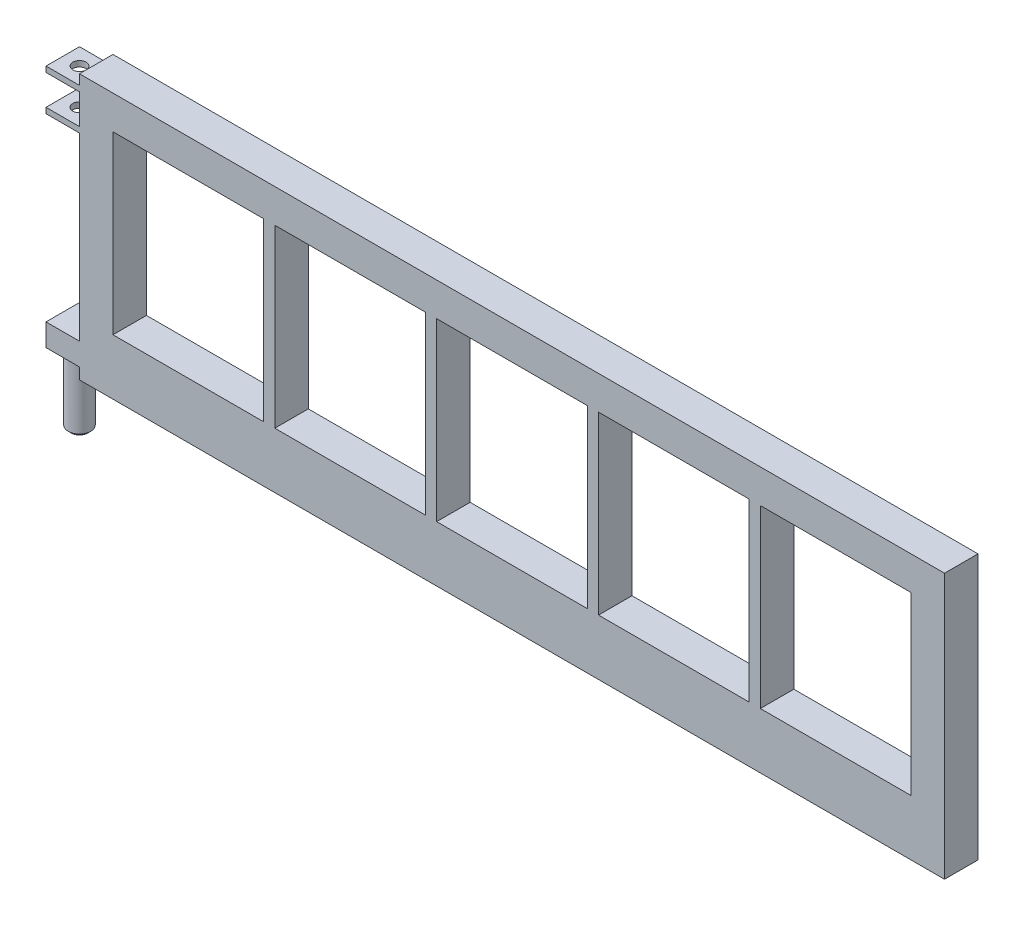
ISO-10303-21;
HEADER;
FILE_DESCRIPTION(('STEP AP214'),'2;1');
FILE_NAME('part.step','',(''),(''),'','','');
FILE_SCHEMA(('AUTOMOTIVE_DESIGN { 1 0 10303 214 1 1 1 1 }'));
ENDSEC;
DATA;
#1=APPLICATION_CONTEXT('core data for automotive mechanical design processes');
#2=APPLICATION_PROTOCOL_DEFINITION('international standard','automotive_design',2000,#1);
#3=PRODUCT_CONTEXT('',#1,'mechanical');
#4=PRODUCT('Part','Part','',(#3));
#5=PRODUCT_RELATED_PRODUCT_CATEGORY('part','',(#4));
#6=PRODUCT_DEFINITION_FORMATION('','',#4);
#7=PRODUCT_DEFINITION_CONTEXT('part definition',#1,'design');
#8=PRODUCT_DEFINITION('design','',#6,#7);
#9=PRODUCT_DEFINITION_SHAPE('','',#8);
#10=(LENGTH_UNIT() NAMED_UNIT(*) SI_UNIT(.MILLI.,.METRE.));
#11=(NAMED_UNIT(*) PLANE_ANGLE_UNIT() SI_UNIT($,.RADIAN.));
#12=(NAMED_UNIT(*) SI_UNIT($,.STERADIAN.) SOLID_ANGLE_UNIT());
#13=UNCERTAINTY_MEASURE_WITH_UNIT(LENGTH_MEASURE(1.E-05),#10,'distance_accuracy_value','');
#14=(GEOMETRIC_REPRESENTATION_CONTEXT(3) GLOBAL_UNCERTAINTY_ASSIGNED_CONTEXT((#13)) GLOBAL_UNIT_ASSIGNED_CONTEXT((#10,
#11,#12)) REPRESENTATION_CONTEXT('',''));
#15=CARTESIAN_POINT('',(0.,0.,0.));
#16=DIRECTION('',(0.,0.,1.));
#17=DIRECTION('',(1.,0.,0.));
#18=AXIS2_PLACEMENT_3D('',#15,#16,#17);
#19=CARTESIAN_POINT('',(-100.,-70.,0.));
#20=DIRECTION('',(0.,0.,1.));
#21=DIRECTION('',(1.,0.,0.));
#22=AXIS2_PLACEMENT_3D('',#19,#20,#21);
#23=PLANE('',#22);
#24=DIRECTION('',(0.,-1.,0.));
#25=VECTOR('',#24,1.);
#26=CARTESIAN_POINT('',(510.,167.501025,0.));
#27=LINE('',#26,#25);
#28=CARTESIAN_POINT('',(510.,137.5,0.));
#29=VERTEX_POINT('',#28);
#30=CARTESIAN_POINT('',(510.,-20.,0.));
#31=VERTEX_POINT('',#30);
#32=EDGE_CURVE('E583',#29,#31,#27,.T.);
#33=ORIENTED_EDGE('',*,*,#32,.T.);
#34=DIRECTION('',(1.,0.,0.));
#35=VECTOR('',#34,1.);
#36=CARTESIAN_POINT('',(-70.,-20.,0.));
#37=LINE('',#36,#35);
#38=CARTESIAN_POINT('',(645.,-20.,0.));
#39=VERTEX_POINT('',#38);
#40=EDGE_CURVE('E652',#31,#39,#37,.T.);
#41=ORIENTED_EDGE('',*,*,#40,.T.);
#42=DIRECTION('',(0.,1.,0.));
#43=VECTOR('',#42,1.);
#44=CARTESIAN_POINT('',(645.,137.5,0.));
#45=LINE('',#44,#43);
#46=CARTESIAN_POINT('',(645.,137.5,0.));
#47=VERTEX_POINT('',#46);
#48=EDGE_CURVE('E656',#39,#47,#45,.T.);
#49=ORIENTED_EDGE('',*,*,#48,.T.);
#50=DIRECTION('',(-1.,0.,0.));
#51=VECTOR('',#50,1.);
#52=CARTESIAN_POINT('',(-70.,137.5,0.));
#53=LINE('',#52,#51);
#54=EDGE_CURVE('E661',#47,#29,#53,.T.);
#55=ORIENTED_EDGE('',*,*,#54,.T.);
#56=EDGE_LOOP('',(#33,#41,#49,#55));
#57=FACE_BOUND('',#56,.T.);
#58=DIRECTION('',(0.,-1.,0.));
#59=VECTOR('',#58,1.);
#60=CARTESIAN_POINT('',(365.,167.501025,0.));
#61=LINE('',#60,#59);
#62=CARTESIAN_POINT('',(365.,137.5,0.));
#63=VERTEX_POINT('',#62);
#64=CARTESIAN_POINT('',(365.,-20.,0.));
#65=VERTEX_POINT('',#64);
#66=EDGE_CURVE('E551',#63,#65,#61,.T.);
#67=ORIENTED_EDGE('',*,*,#66,.T.);
#68=CARTESIAN_POINT('',(500.,-20.,0.));
#69=VERTEX_POINT('',#68);
#70=EDGE_CURVE('E746',#65,#69,#37,.T.);
#71=ORIENTED_EDGE('',*,*,#70,.T.);
#72=DIRECTION('',(0.,-1.,0.));
#73=VECTOR('',#72,1.);
#74=CARTESIAN_POINT('',(500.,167.501025,0.));
#75=LINE('',#74,#73);
#76=CARTESIAN_POINT('',(500.,137.5,0.));
#77=VERTEX_POINT('',#76);
#78=EDGE_CURVE('E580',#77,#69,#75,.T.);
#79=ORIENTED_EDGE('',*,*,#78,.F.);
#80=EDGE_CURVE('E665',#77,#63,#53,.T.);
#81=ORIENTED_EDGE('',*,*,#80,.T.);
#82=EDGE_LOOP('',(#67,#71,#79,#81));
#83=FACE_BOUND('',#82,.T.);
#84=DIRECTION('',(0.,-1.,0.));
#85=VECTOR('',#84,1.);
#86=CARTESIAN_POINT('',(220.,167.501025,0.));
#87=LINE('',#86,#85);
#88=CARTESIAN_POINT('',(220.,137.5,0.));
#89=VERTEX_POINT('',#88);
#90=CARTESIAN_POINT('',(220.,-20.,0.));
#91=VERTEX_POINT('',#90);
#92=EDGE_CURVE('E530',#89,#91,#87,.T.);
#93=ORIENTED_EDGE('',*,*,#92,.T.);
#94=CARTESIAN_POINT('',(355.,-20.,0.));
#95=VERTEX_POINT('',#94);
#96=EDGE_CURVE('E747',#91,#95,#37,.T.);
#97=ORIENTED_EDGE('',*,*,#96,.T.);
#98=DIRECTION('',(0.,-1.,0.));
#99=VECTOR('',#98,1.);
#100=CARTESIAN_POINT('',(355.,167.501025,0.));
#101=LINE('',#100,#99);
#102=CARTESIAN_POINT('',(355.,137.5,0.));
#103=VERTEX_POINT('',#102);
#104=EDGE_CURVE('E548',#103,#95,#101,.T.);
#105=ORIENTED_EDGE('',*,*,#104,.F.);
#106=EDGE_CURVE('E705',#103,#89,#53,.T.);
#107=ORIENTED_EDGE('',*,*,#106,.T.);
#108=EDGE_LOOP('',(#93,#97,#105,#107));
#109=FACE_BOUND('',#108,.T.);
#110=DIRECTION('',(0.,-1.,0.));
#111=VECTOR('',#110,1.);
#112=CARTESIAN_POINT('',(75.0000000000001,167.501025,0.));
#113=LINE('',#112,#111);
#114=CARTESIAN_POINT('',(75.0000000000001,137.5,0.));
#115=VERTEX_POINT('',#114);
#116=CARTESIAN_POINT('',(75.0000000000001,-20.,0.));
#117=VERTEX_POINT('',#116);
#118=EDGE_CURVE('E511',#115,#117,#113,.T.);
#119=ORIENTED_EDGE('',*,*,#118,.T.);
#120=CARTESIAN_POINT('',(210.,-20.,0.));
#121=VERTEX_POINT('',#120);
#122=EDGE_CURVE('E657',#117,#121,#37,.T.);
#123=ORIENTED_EDGE('',*,*,#122,.T.);
#124=DIRECTION('',(0.,-1.,0.));
#125=VECTOR('',#124,1.);
#126=CARTESIAN_POINT('',(210.,167.501025,0.));
#127=LINE('',#126,#125);
#128=CARTESIAN_POINT('',(210.,137.5,0.));
#129=VERTEX_POINT('',#128);
#130=EDGE_CURVE('E527',#129,#121,#127,.T.);
#131=ORIENTED_EDGE('',*,*,#130,.F.);
#132=EDGE_CURVE('E703',#129,#115,#53,.T.);
#133=ORIENTED_EDGE('',*,*,#132,.T.);
#134=EDGE_LOOP('',(#119,#123,#131,#133));
#135=FACE_BOUND('',#134,.T.);
#136=CARTESIAN_POINT('',(-70.,-20.,0.));
#137=VERTEX_POINT('',#136);
#138=CARTESIAN_POINT('',(65.0000000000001,-20.,0.));
#139=VERTEX_POINT('',#138);
#140=EDGE_CURVE('E653',#137,#139,#37,.T.);
#141=ORIENTED_EDGE('',*,*,#140,.T.);
#142=DIRECTION('',(0.,-1.,0.));
#143=VECTOR('',#142,1.);
#144=CARTESIAN_POINT('',(65.0000000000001,167.501025,0.));
#145=LINE('',#144,#143);
#146=CARTESIAN_POINT('',(65.0000000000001,137.5,0.));
#147=VERTEX_POINT('',#146);
#148=EDGE_CURVE('E508',#147,#139,#145,.T.);
#149=ORIENTED_EDGE('',*,*,#148,.F.);
#150=CARTESIAN_POINT('',(-70.,137.5,0.));
#151=VERTEX_POINT('',#150);
#152=EDGE_CURVE('E660',#147,#151,#53,.T.);
#153=ORIENTED_EDGE('',*,*,#152,.T.);
#154=DIRECTION('',(0.,-1.,0.));
#155=VECTOR('',#154,1.);
#156=CARTESIAN_POINT('',(-70.,137.5,0.));
#157=LINE('',#156,#155);
#158=EDGE_CURVE('E443',#151,#137,#157,.T.);
#159=ORIENTED_EDGE('',*,*,#158,.T.);
#160=EDGE_LOOP('',(#141,#149,#153,#159));
#161=FACE_BOUND('',#160,.T.);
#162=DIRECTION('',(-1.,0.,0.));
#163=VECTOR('',#162,1.);
#164=CARTESIAN_POINT('',(675.,-50.1663230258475,0.));
#165=LINE('',#164,#163);
#166=CARTESIAN_POINT('',(675.,-50.1663230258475,0.));
#167=VERTEX_POINT('',#166);
#168=CARTESIAN_POINT('',(646.097963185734,-50.1663230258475,0.));
#169=VERTEX_POINT('',#168);
#170=EDGE_CURVE('E299',#167,#169,#165,.T.);
#171=ORIENTED_EDGE('',*,*,#170,.F.);
#172=DIRECTION('',(0.,1.,0.));
#173=VECTOR('',#172,1.);
#174=CARTESIAN_POINT('',(675.,167.5,0.));
#175=LINE('',#174,#173);
#176=CARTESIAN_POINT('',(675.,-70.,0.));
#177=VERTEX_POINT('',#176);
#178=EDGE_CURVE('E313',#177,#167,#175,.T.);
#179=ORIENTED_EDGE('',*,*,#178,.F.);
#180=DIRECTION('',(1.,0.,0.));
#181=VECTOR('',#180,1.);
#182=CARTESIAN_POINT('',(-100.,-70.,0.));
#183=LINE('',#182,#181);
#184=CARTESIAN_POINT('',(-100.,-70.,0.));
#185=VERTEX_POINT('',#184);
#186=EDGE_CURVE('E324',#185,#177,#183,.T.);
#187=ORIENTED_EDGE('',*,*,#186,.F.);
#188=DIRECTION('',(0.,-1.,0.));
#189=VECTOR('',#188,1.);
#190=CARTESIAN_POINT('',(-100.,167.5,0.));
#191=LINE('',#190,#189);
#192=CARTESIAN_POINT('',(-100.,-60.,0.));
#193=VERTEX_POINT('',#192);
#194=EDGE_CURVE('E361',#193,#185,#191,.T.);
#195=ORIENTED_EDGE('',*,*,#194,.F.);
#196=DIRECTION('',(1.,0.,0.));
#197=VECTOR('',#196,1.);
#198=CARTESIAN_POINT('',(-130.,-60.,0.));
#199=LINE('',#198,#197);
#200=CARTESIAN_POINT('',(-130.,-60.,0.));
#201=VERTEX_POINT('',#200);
#202=EDGE_CURVE('E492',#201,#193,#199,.T.);
#203=ORIENTED_EDGE('',*,*,#202,.F.);
#204=DIRECTION('',(0.,-1.,0.));
#205=VECTOR('',#204,1.);
#206=CARTESIAN_POINT('',(-130.,-60.,0.));
#207=LINE('',#206,#205);
#208=CARTESIAN_POINT('',(-130.,-40.,0.));
#209=VERTEX_POINT('',#208);
#210=EDGE_CURVE('E491',#209,#201,#207,.T.);
#211=ORIENTED_EDGE('',*,*,#210,.F.);
#212=DIRECTION('',(1.,0.,0.));
#213=VECTOR('',#212,1.);
#214=CARTESIAN_POINT('',(-130.,-40.,0.));
#215=LINE('',#214,#213);
#216=CARTESIAN_POINT('',(-100.,-40.,0.));
#217=VERTEX_POINT('',#216);
#218=EDGE_CURVE('E484',#209,#217,#215,.T.);
#219=ORIENTED_EDGE('',*,*,#218,.T.);
#220=CARTESIAN_POINT('',(-100.,121.5,0.));
#221=VERTEX_POINT('',#220);
#222=EDGE_CURVE('E354',#221,#217,#191,.T.);
#223=ORIENTED_EDGE('',*,*,#222,.F.);
#224=DIRECTION('',(1.,0.,0.));
#225=VECTOR('',#224,1.);
#226=CARTESIAN_POINT('',(-130.,121.5,0.));
#227=LINE('',#226,#225);
#228=CARTESIAN_POINT('',(-130.,121.5,0.));
#229=VERTEX_POINT('',#228);
#230=EDGE_CURVE('E425',#229,#221,#227,.T.);
#231=ORIENTED_EDGE('',*,*,#230,.F.);
#232=DIRECTION('',(0.,-1.,0.));
#233=VECTOR('',#232,1.);
#234=CARTESIAN_POINT('',(-130.,126.5,0.));
#235=LINE('',#234,#233);
#236=CARTESIAN_POINT('',(-130.,126.5,0.));
#237=VERTEX_POINT('',#236);
#238=EDGE_CURVE('E597',#237,#229,#235,.T.);
#239=ORIENTED_EDGE('',*,*,#238,.F.);
#240=DIRECTION('',(1.,0.,0.));
#241=VECTOR('',#240,1.);
#242=CARTESIAN_POINT('',(-130.,126.5,0.));
#243=LINE('',#242,#241);
#244=CARTESIAN_POINT('',(-100.,126.5,0.));
#245=VERTEX_POINT('',#244);
#246=EDGE_CURVE('E420',#237,#245,#243,.T.);
#247=ORIENTED_EDGE('',*,*,#246,.T.);
#248=CARTESIAN_POINT('',(-100.,153.5,0.));
#249=VERTEX_POINT('',#248);
#250=EDGE_CURVE('E370',#249,#245,#191,.T.);
#251=ORIENTED_EDGE('',*,*,#250,.F.);
#252=DIRECTION('',(1.,0.,0.));
#253=VECTOR('',#252,1.);
#254=CARTESIAN_POINT('',(-130.,153.5,0.));
#255=LINE('',#254,#253);
#256=CARTESIAN_POINT('',(-130.,153.5,0.));
#257=VERTEX_POINT('',#256);
#258=EDGE_CURVE('E439',#257,#249,#255,.T.);
#259=ORIENTED_EDGE('',*,*,#258,.F.);
#260=DIRECTION('',(0.,-1.,0.));
#261=VECTOR('',#260,1.);
#262=CARTESIAN_POINT('',(-130.,158.5,0.));
#263=LINE('',#262,#261);
#264=CARTESIAN_POINT('',(-130.,158.5,0.));
#265=VERTEX_POINT('',#264);
#266=EDGE_CURVE('E464',#265,#257,#263,.T.);
#267=ORIENTED_EDGE('',*,*,#266,.F.);
#268=DIRECTION('',(1.,0.,0.));
#269=VECTOR('',#268,1.);
#270=CARTESIAN_POINT('',(-130.,158.5,0.));
#271=LINE('',#270,#269);
#272=CARTESIAN_POINT('',(-100.,158.5,0.));
#273=VERTEX_POINT('',#272);
#274=EDGE_CURVE('E434',#265,#273,#271,.T.);
#275=ORIENTED_EDGE('',*,*,#274,.T.);
#276=CARTESIAN_POINT('',(-100.,167.5,0.));
#277=VERTEX_POINT('',#276);
#278=EDGE_CURVE('E331',#277,#273,#191,.T.);
#279=ORIENTED_EDGE('',*,*,#278,.F.);
#280=DIRECTION('',(-1.,0.,0.));
#281=VECTOR('',#280,1.);
#282=CARTESIAN_POINT('',(-100.,167.5,0.));
#283=LINE('',#282,#281);
#284=CARTESIAN_POINT('',(646.097963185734,167.5,0.));
#285=VERTEX_POINT('',#284);
#286=EDGE_CURVE('E323',#285,#277,#283,.T.);
#287=ORIENTED_EDGE('',*,*,#286,.F.);
#288=DIRECTION('',(0.,1.,0.));
#289=VECTOR('',#288,1.);
#290=CARTESIAN_POINT('',(646.097963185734,167.5,0.));
#291=LINE('',#290,#289);
#292=EDGE_CURVE('E315',#169,#285,#291,.T.);
#293=ORIENTED_EDGE('',*,*,#292,.F.);
#294=EDGE_LOOP('',(#171,#179,#187,#195,#203,#211,#219,#223,#231,#239,#247,#251,#259,#267,#275,
#279,#287,#293));
#295=FACE_BOUND('',#294,.T.);
#296=ADVANCED_FACE('F42',(#57,#83,#109,#135,#161,#295),#23,.F.);
#297=CARTESIAN_POINT('',(-130.,-60.,30.));
#298=DIRECTION('',(0.,1.,0.));
#299=DIRECTION('',(-1.,0.,0.));
#300=AXIS2_PLACEMENT_3D('',#297,#298,#299);
#301=PLANE('',#300);
#302=DIRECTION('',(0.,0.,1.));
#303=VECTOR('',#302,1.);
#304=CARTESIAN_POINT('',(-100.,-60.,30.));
#305=LINE('',#304,#303);
#306=CARTESIAN_POINT('',(-100.,-60.,30.));
#307=VERTEX_POINT('',#306);
#308=EDGE_CURVE('E488',#193,#307,#305,.T.);
#309=ORIENTED_EDGE('',*,*,#308,.T.);
#310=DIRECTION('',(1.,0.,0.));
#311=VECTOR('',#310,1.);
#312=CARTESIAN_POINT('',(-130.,-60.,30.));
#313=LINE('',#312,#311);
#314=CARTESIAN_POINT('',(-130.,-60.,30.));
#315=VERTEX_POINT('',#314);
#316=EDGE_CURVE('E500',#315,#307,#313,.T.);
#317=ORIENTED_EDGE('',*,*,#316,.F.);
#318=DIRECTION('',(0.,0.,1.));
#319=VECTOR('',#318,1.);
#320=CARTESIAN_POINT('',(-130.,-60.,30.));
#321=LINE('',#320,#319);
#322=EDGE_CURVE('E623',#201,#315,#321,.T.);
#323=ORIENTED_EDGE('',*,*,#322,.F.);
#324=ORIENTED_EDGE('',*,*,#202,.T.);
#325=EDGE_LOOP('',(#309,#317,#323,#324));
#326=FACE_BOUND('',#325,.T.);
#327=CARTESIAN_POINT('',(-115.,-60.,15.));
#328=DIRECTION('',(0.,1.,0.));
#329=DIRECTION('',(-1.,0.,0.));
#330=AXIS2_PLACEMENT_3D('',#327,#328,#329);
#331=CIRCLE('',#330,9.99999999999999);
#332=CARTESIAN_POINT('',(-125.,-60.,15.));
#333=VERTEX_POINT('',#332);
#334=EDGE_CURVE('E378',#333,#333,#331,.F.);
#335=ORIENTED_EDGE('',*,*,#334,.F.);
#336=EDGE_LOOP('',(#335));
#337=FACE_BOUND('',#336,.T.);
#338=ADVANCED_FACE('F627',(#326,#337),#301,.F.);
#339=CARTESIAN_POINT('',(-100.,167.5,30.));
#340=DIRECTION('',(1.,0.,0.));
#341=DIRECTION('',(0.,1.,0.));
#342=AXIS2_PLACEMENT_3D('',#339,#340,#341);
#343=PLANE('',#342);
#344=DIRECTION('',(0.,0.,-1.));
#345=VECTOR('',#344,1.);
#346=CARTESIAN_POINT('',(-100.,-40.,30.));
#347=LINE('',#346,#345);
#348=CARTESIAN_POINT('',(-100.,-40.,30.));
#349=VERTEX_POINT('',#348);
#350=EDGE_CURVE('E306',#349,#217,#347,.T.);
#351=ORIENTED_EDGE('',*,*,#350,.F.);
#352=DIRECTION('',(0.,-1.,0.));
#353=VECTOR('',#352,1.);
#354=CARTESIAN_POINT('',(-100.,167.5,30.));
#355=LINE('',#354,#353);
#356=CARTESIAN_POINT('',(-100.,121.5,30.));
#357=VERTEX_POINT('',#356);
#358=EDGE_CURVE('E350',#357,#349,#355,.T.);
#359=ORIENTED_EDGE('',*,*,#358,.F.);
#360=DIRECTION('',(0.,0.,1.));
#361=VECTOR('',#360,1.);
#362=CARTESIAN_POINT('',(-100.,121.5,30.));
#363=LINE('',#362,#361);
#364=EDGE_CURVE('E476',#221,#357,#363,.T.);
#365=ORIENTED_EDGE('',*,*,#364,.F.);
#366=ORIENTED_EDGE('',*,*,#222,.T.);
#367=EDGE_LOOP('',(#351,#359,#365,#366));
#368=FACE_BOUND('',#367,.T.);
#369=ADVANCED_FACE('F474',(#368),#343,.F.);
#370=ORIENTED_EDGE('',*,*,#308,.F.);
#371=ORIENTED_EDGE('',*,*,#194,.T.);
#372=DIRECTION('',(0.,0.,-1.));
#373=VECTOR('',#372,1.);
#374=CARTESIAN_POINT('',(-100.,-70.,30.));
#375=LINE('',#374,#373);
#376=CARTESIAN_POINT('',(-100.,-70.,30.));
#377=VERTEX_POINT('',#376);
#378=EDGE_CURVE('E375',#377,#185,#375,.T.);
#379=ORIENTED_EDGE('',*,*,#378,.F.);
#380=EDGE_CURVE('E65',#307,#377,#355,.T.);
#381=ORIENTED_EDGE('',*,*,#380,.F.);
#382=EDGE_LOOP('',(#370,#371,#379,#381));
#383=FACE_BOUND('',#382,.T.);
#384=ADVANCED_FACE('F629',(#383),#343,.F.);
#385=CARTESIAN_POINT('',(-70.,-20.,30.));
#386=DIRECTION('',(0.,1.,0.));
#387=DIRECTION('',(-1.,0.,0.));
#388=AXIS2_PLACEMENT_3D('',#385,#386,#387);
#389=PLANE('',#388);
#390=ORIENTED_EDGE('',*,*,#122,.F.);
#391=DIRECTION('',(0.,0.,-1.));
#392=VECTOR('',#391,1.);
#393=CARTESIAN_POINT('',(75.0000000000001,-20.,30.));
#394=LINE('',#393,#392);
#395=CARTESIAN_POINT('',(75.0000000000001,-20.,30.));
#396=VERTEX_POINT('',#395);
#397=EDGE_CURVE('E509',#396,#117,#394,.T.);
#398=ORIENTED_EDGE('',*,*,#397,.F.);
#399=DIRECTION('',(1.,0.,0.));
#400=VECTOR('',#399,1.);
#401=CARTESIAN_POINT('',(-70.,-20.,30.));
#402=LINE('',#401,#400);
#403=CARTESIAN_POINT('',(210.,-20.,30.));
#404=VERTEX_POINT('',#403);
#405=EDGE_CURVE('E672',#396,#404,#402,.T.);
#406=ORIENTED_EDGE('',*,*,#405,.T.);
#407=DIRECTION('',(0.,0.,1.));
#408=VECTOR('',#407,1.);
#409=CARTESIAN_POINT('',(210.,-20.,30.));
#410=LINE('',#409,#408);
#411=EDGE_CURVE('E523',#121,#404,#410,.T.);
#412=ORIENTED_EDGE('',*,*,#411,.F.);
#413=EDGE_LOOP('',(#390,#398,#406,#412));
#414=FACE_BOUND('',#413,.T.);
#415=ADVANCED_FACE('F756',(#414),#389,.T.);
#416=CARTESIAN_POINT('',(-70.,-20.,30.));
#417=VERTEX_POINT('',#416);
#418=CARTESIAN_POINT('',(65.0000000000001,-20.,30.));
#419=VERTEX_POINT('',#418);
#420=EDGE_CURVE('E668',#417,#419,#402,.T.);
#421=ORIENTED_EDGE('',*,*,#420,.T.);
#422=DIRECTION('',(0.,0.,1.));
#423=VECTOR('',#422,1.);
#424=CARTESIAN_POINT('',(65.0000000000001,-20.,30.));
#425=LINE('',#424,#423);
#426=EDGE_CURVE('E504',#139,#419,#425,.T.);
#427=ORIENTED_EDGE('',*,*,#426,.F.);
#428=ORIENTED_EDGE('',*,*,#140,.F.);
#429=DIRECTION('',(0.,0.,-1.));
#430=VECTOR('',#429,1.);
#431=CARTESIAN_POINT('',(-70.,-20.,30.));
#432=LINE('',#431,#430);
#433=EDGE_CURVE('E363',#417,#137,#432,.T.);
#434=ORIENTED_EDGE('',*,*,#433,.F.);
#435=EDGE_LOOP('',(#421,#427,#428,#434));
#436=FACE_BOUND('',#435,.T.);
#437=ADVANCED_FACE('F1099',(#436),#389,.T.);
#438=CARTESIAN_POINT('',(-70.,137.5,30.));
#439=DIRECTION('',(0.,-1.,0.));
#440=DIRECTION('',(0.,0.,-1.));
#441=AXIS2_PLACEMENT_3D('',#438,#439,#440);
#442=PLANE('',#441);
#443=DIRECTION('',(-1.,0.,0.));
#444=VECTOR('',#443,1.);
#445=CARTESIAN_POINT('',(-70.,137.5,30.));
#446=LINE('',#445,#444);
#447=CARTESIAN_POINT('',(210.,137.5,30.));
#448=VERTEX_POINT('',#447);
#449=CARTESIAN_POINT('',(75.0000000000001,137.5,30.));
#450=VERTEX_POINT('',#449);
#451=EDGE_CURVE('E763',#448,#450,#446,.T.);
#452=ORIENTED_EDGE('',*,*,#451,.T.);
#453=DIRECTION('',(0.,0.,1.));
#454=VECTOR('',#453,1.);
#455=CARTESIAN_POINT('',(75.0000000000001,137.5,30.));
#456=LINE('',#455,#454);
#457=EDGE_CURVE('E496',#115,#450,#456,.T.);
#458=ORIENTED_EDGE('',*,*,#457,.F.);
#459=ORIENTED_EDGE('',*,*,#132,.F.);
#460=DIRECTION('',(0.,0.,-1.));
#461=VECTOR('',#460,1.);
#462=CARTESIAN_POINT('',(210.,137.5,30.));
#463=LINE('',#462,#461);
#464=EDGE_CURVE('E533',#448,#129,#463,.T.);
#465=ORIENTED_EDGE('',*,*,#464,.F.);
#466=EDGE_LOOP('',(#452,#458,#459,#465));
#467=FACE_BOUND('',#466,.T.);
#468=ADVANCED_FACE('F765',(#467),#442,.T.);
#469=ORIENTED_EDGE('',*,*,#152,.F.);
#470=DIRECTION('',(0.,0.,-1.));
#471=VECTOR('',#470,1.);
#472=CARTESIAN_POINT('',(65.0000000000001,137.5,30.));
#473=LINE('',#472,#471);
#474=CARTESIAN_POINT('',(65.0000000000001,137.5,30.));
#475=VERTEX_POINT('',#474);
#476=EDGE_CURVE('E514',#475,#147,#473,.T.);
#477=ORIENTED_EDGE('',*,*,#476,.F.);
#478=CARTESIAN_POINT('',(-70.,137.5,30.));
#479=VERTEX_POINT('',#478);
#480=EDGE_CURVE('E675',#475,#479,#446,.T.);
#481=ORIENTED_EDGE('',*,*,#480,.T.);
#482=DIRECTION('',(0.,0.,-1.));
#483=VECTOR('',#482,1.);
#484=CARTESIAN_POINT('',(-70.,137.5,30.));
#485=LINE('',#484,#483);
#486=EDGE_CURVE('E679',#479,#151,#485,.T.);
#487=ORIENTED_EDGE('',*,*,#486,.T.);
#488=EDGE_LOOP('',(#469,#477,#481,#487));
#489=FACE_BOUND('',#488,.T.);
#490=ADVANCED_FACE('F1097',(#489),#442,.T.);
#491=ORIENTED_EDGE('',*,*,#96,.F.);
#492=DIRECTION('',(0.,0.,-1.));
#493=VECTOR('',#492,1.);
#494=CARTESIAN_POINT('',(220.,-20.,30.));
#495=LINE('',#494,#493);
#496=CARTESIAN_POINT('',(220.,-20.,30.));
#497=VERTEX_POINT('',#496);
#498=EDGE_CURVE('E528',#497,#91,#495,.T.);
#499=ORIENTED_EDGE('',*,*,#498,.F.);
#500=CARTESIAN_POINT('',(355.,-20.,30.));
#501=VERTEX_POINT('',#500);
#502=EDGE_CURVE('E732',#497,#501,#402,.T.);
#503=ORIENTED_EDGE('',*,*,#502,.T.);
#504=DIRECTION('',(0.,0.,1.));
#505=VECTOR('',#504,1.);
#506=CARTESIAN_POINT('',(355.,-20.,30.));
#507=LINE('',#506,#505);
#508=EDGE_CURVE('E544',#95,#501,#507,.T.);
#509=ORIENTED_EDGE('',*,*,#508,.F.);
#510=EDGE_LOOP('',(#491,#499,#503,#509));
#511=FACE_BOUND('',#510,.T.);
#512=ADVANCED_FACE('F1092',(#511),#389,.T.);
#513=CARTESIAN_POINT('',(355.,137.5,30.));
#514=VERTEX_POINT('',#513);
#515=CARTESIAN_POINT('',(220.,137.5,30.));
#516=VERTEX_POINT('',#515);
#517=EDGE_CURVE('E1218',#514,#516,#446,.T.);
#518=ORIENTED_EDGE('',*,*,#517,.T.);
#519=DIRECTION('',(0.,0.,1.));
#520=VECTOR('',#519,1.);
#521=CARTESIAN_POINT('',(220.,137.5,30.));
#522=LINE('',#521,#520);
#523=EDGE_CURVE('E521',#89,#516,#522,.T.);
#524=ORIENTED_EDGE('',*,*,#523,.F.);
#525=ORIENTED_EDGE('',*,*,#106,.F.);
#526=DIRECTION('',(0.,0.,-1.));
#527=VECTOR('',#526,1.);
#528=CARTESIAN_POINT('',(355.,137.5,30.));
#529=LINE('',#528,#527);
#530=EDGE_CURVE('E554',#514,#103,#529,.T.);
#531=ORIENTED_EDGE('',*,*,#530,.F.);
#532=EDGE_LOOP('',(#518,#524,#525,#531));
#533=FACE_BOUND('',#532,.T.);
#534=ADVANCED_FACE('F1096',(#533),#442,.T.);
#535=ORIENTED_EDGE('',*,*,#70,.F.);
#536=DIRECTION('',(0.,0.,-1.));
#537=VECTOR('',#536,1.);
#538=CARTESIAN_POINT('',(365.,-20.,30.));
#539=LINE('',#538,#537);
#540=CARTESIAN_POINT('',(365.,-20.,30.));
#541=VERTEX_POINT('',#540);
#542=EDGE_CURVE('E549',#541,#65,#539,.T.);
#543=ORIENTED_EDGE('',*,*,#542,.F.);
#544=CARTESIAN_POINT('',(500.,-20.,30.));
#545=VERTEX_POINT('',#544);
#546=EDGE_CURVE('E729',#541,#545,#402,.T.);
#547=ORIENTED_EDGE('',*,*,#546,.T.);
#548=DIRECTION('',(0.,0.,1.));
#549=VECTOR('',#548,1.);
#550=CARTESIAN_POINT('',(500.,-20.,30.));
#551=LINE('',#550,#549);
#552=EDGE_CURVE('E572',#69,#545,#551,.T.);
#553=ORIENTED_EDGE('',*,*,#552,.F.);
#554=EDGE_LOOP('',(#535,#543,#547,#553));
#555=FACE_BOUND('',#554,.T.);
#556=ADVANCED_FACE('F1112',(#555),#389,.T.);
#557=CARTESIAN_POINT('',(500.,137.5,30.));
#558=VERTEX_POINT('',#557);
#559=CARTESIAN_POINT('',(365.,137.5,30.));
#560=VERTEX_POINT('',#559);
#561=EDGE_CURVE('E680',#558,#560,#446,.T.);
#562=ORIENTED_EDGE('',*,*,#561,.T.);
#563=DIRECTION('',(0.,0.,1.));
#564=VECTOR('',#563,1.);
#565=CARTESIAN_POINT('',(365.,137.5,30.));
#566=LINE('',#565,#564);
#567=EDGE_CURVE('E542',#63,#560,#566,.T.);
#568=ORIENTED_EDGE('',*,*,#567,.F.);
#569=ORIENTED_EDGE('',*,*,#80,.F.);
#570=DIRECTION('',(0.,0.,-1.));
#571=VECTOR('',#570,1.);
#572=CARTESIAN_POINT('',(500.,137.5,30.));
#573=LINE('',#572,#571);
#574=EDGE_CURVE('E564',#558,#77,#573,.T.);
#575=ORIENTED_EDGE('',*,*,#574,.F.);
#576=EDGE_LOOP('',(#562,#568,#569,#575));
#577=FACE_BOUND('',#576,.T.);
#578=ADVANCED_FACE('F720',(#577),#442,.T.);
#579=ORIENTED_EDGE('',*,*,#40,.F.);
#580=DIRECTION('',(0.,0.,-1.));
#581=VECTOR('',#580,1.);
#582=CARTESIAN_POINT('',(510.,-20.,30.));
#583=LINE('',#582,#581);
#584=CARTESIAN_POINT('',(510.,-20.,30.));
#585=VERTEX_POINT('',#584);
#586=EDGE_CURVE('E569',#585,#31,#583,.T.);
#587=ORIENTED_EDGE('',*,*,#586,.F.);
#588=CARTESIAN_POINT('',(645.,-20.,30.));
#589=VERTEX_POINT('',#588);
#590=EDGE_CURVE('E667',#585,#589,#402,.T.);
#591=ORIENTED_EDGE('',*,*,#590,.T.);
#592=DIRECTION('',(0.,0.,-1.));
#593=VECTOR('',#592,1.);
#594=CARTESIAN_POINT('',(645.,-20.,30.));
#595=LINE('',#594,#593);
#596=EDGE_CURVE('E684',#589,#39,#595,.T.);
#597=ORIENTED_EDGE('',*,*,#596,.T.);
#598=EDGE_LOOP('',(#579,#587,#591,#597));
#599=FACE_BOUND('',#598,.T.);
#600=ADVANCED_FACE('F735',(#599),#389,.T.);
#601=CARTESIAN_POINT('',(645.,137.5,30.));
#602=VERTEX_POINT('',#601);
#603=CARTESIAN_POINT('',(510.,137.5,30.));
#604=VERTEX_POINT('',#603);
#605=EDGE_CURVE('E676',#602,#604,#446,.T.);
#606=ORIENTED_EDGE('',*,*,#605,.T.);
#607=DIRECTION('',(0.,0.,1.));
#608=VECTOR('',#607,1.);
#609=CARTESIAN_POINT('',(510.,137.5,30.));
#610=LINE('',#609,#608);
#611=EDGE_CURVE('E567',#29,#604,#610,.T.);
#612=ORIENTED_EDGE('',*,*,#611,.F.);
#613=ORIENTED_EDGE('',*,*,#54,.F.);
#614=DIRECTION('',(0.,0.,-1.));
#615=VECTOR('',#614,1.);
#616=CARTESIAN_POINT('',(645.,137.5,30.));
#617=LINE('',#616,#615);
#618=EDGE_CURVE('E683',#602,#47,#617,.T.);
#619=ORIENTED_EDGE('',*,*,#618,.F.);
#620=EDGE_LOOP('',(#606,#612,#613,#619));
#621=FACE_BOUND('',#620,.T.);
#622=ADVANCED_FACE('F743',(#621),#442,.T.);
#623=DIRECTION('',(0.,0.,-1.));
#624=VECTOR('',#623,1.);
#625=CARTESIAN_POINT('',(-100.,126.5,30.));
#626=LINE('',#625,#624);
#627=CARTESIAN_POINT('',(-100.,126.5,30.));
#628=VERTEX_POINT('',#627);
#629=EDGE_CURVE('E415',#628,#245,#626,.T.);
#630=ORIENTED_EDGE('',*,*,#629,.F.);
#631=CARTESIAN_POINT('',(-100.,153.5,30.));
#632=VERTEX_POINT('',#631);
#633=EDGE_CURVE('E342',#632,#628,#355,.T.);
#634=ORIENTED_EDGE('',*,*,#633,.F.);
#635=DIRECTION('',(0.,0.,1.));
#636=VECTOR('',#635,1.);
#637=CARTESIAN_POINT('',(-100.,153.5,30.));
#638=LINE('',#637,#636);
#639=EDGE_CURVE('E423',#249,#632,#638,.T.);
#640=ORIENTED_EDGE('',*,*,#639,.F.);
#641=ORIENTED_EDGE('',*,*,#250,.T.);
#642=EDGE_LOOP('',(#630,#634,#640,#641));
#643=FACE_BOUND('',#642,.T.);
#644=ADVANCED_FACE('F44',(#643),#343,.F.);
#645=DIRECTION('',(0.,0.,-1.));
#646=VECTOR('',#645,1.);
#647=CARTESIAN_POINT('',(-100.,158.5,30.));
#648=LINE('',#647,#646);
#649=CARTESIAN_POINT('',(-100.,158.5,30.));
#650=VERTEX_POINT('',#649);
#651=EDGE_CURVE('E419',#650,#273,#648,.T.);
#652=ORIENTED_EDGE('',*,*,#651,.F.);
#653=CARTESIAN_POINT('',(-100.,167.5,30.));
#654=VERTEX_POINT('',#653);
#655=EDGE_CURVE('E347',#654,#650,#355,.T.);
#656=ORIENTED_EDGE('',*,*,#655,.F.);
#657=DIRECTION('',(0.,0.,-1.));
#658=VECTOR('',#657,1.);
#659=CARTESIAN_POINT('',(-100.,167.5,30.));
#660=LINE('',#659,#658);
#661=EDGE_CURVE('E382',#654,#277,#660,.T.);
#662=ORIENTED_EDGE('',*,*,#661,.T.);
#663=ORIENTED_EDGE('',*,*,#278,.T.);
#664=EDGE_LOOP('',(#652,#656,#662,#663));
#665=FACE_BOUND('',#664,.T.);
#666=ADVANCED_FACE('F639',(#665),#343,.F.);
#667=CARTESIAN_POINT('',(-100.,-70.,30.));
#668=DIRECTION('',(0.,0.,1.));
#669=DIRECTION('',(1.,0.,0.));
#670=AXIS2_PLACEMENT_3D('',#667,#668,#669);
#671=PLANE('',#670);
#672=ORIENTED_EDGE('',*,*,#405,.F.);
#673=DIRECTION('',(0.,-1.,0.));
#674=VECTOR('',#673,1.);
#675=CARTESIAN_POINT('',(75.0000000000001,167.501025,30.));
#676=LINE('',#675,#674);
#677=EDGE_CURVE('E512',#450,#396,#676,.T.);
#678=ORIENTED_EDGE('',*,*,#677,.F.);
#679=ORIENTED_EDGE('',*,*,#451,.F.);
#680=DIRECTION('',(0.,-1.,0.));
#681=VECTOR('',#680,1.);
#682=CARTESIAN_POINT('',(210.,167.501025,30.));
#683=LINE('',#682,#681);
#684=EDGE_CURVE('E526',#448,#404,#683,.T.);
#685=ORIENTED_EDGE('',*,*,#684,.T.);
#686=EDGE_LOOP('',(#672,#678,#679,#685));
#687=FACE_BOUND('',#686,.T.);
#688=ORIENTED_EDGE('',*,*,#502,.F.);
#689=DIRECTION('',(0.,-1.,0.));
#690=VECTOR('',#689,1.);
#691=CARTESIAN_POINT('',(220.,167.501025,30.));
#692=LINE('',#691,#690);
#693=EDGE_CURVE('E531',#516,#497,#692,.T.);
#694=ORIENTED_EDGE('',*,*,#693,.F.);
#695=ORIENTED_EDGE('',*,*,#517,.F.);
#696=DIRECTION('',(0.,-1.,0.));
#697=VECTOR('',#696,1.);
#698=CARTESIAN_POINT('',(355.,167.501025,30.));
#699=LINE('',#698,#697);
#700=EDGE_CURVE('E547',#514,#501,#699,.T.);
#701=ORIENTED_EDGE('',*,*,#700,.T.);
#702=EDGE_LOOP('',(#688,#694,#695,#701));
#703=FACE_BOUND('',#702,.T.);
#704=ORIENTED_EDGE('',*,*,#546,.F.);
#705=DIRECTION('',(0.,-1.,0.));
#706=VECTOR('',#705,1.);
#707=CARTESIAN_POINT('',(365.,167.501025,30.));
#708=LINE('',#707,#706);
#709=EDGE_CURVE('E552',#560,#541,#708,.T.);
#710=ORIENTED_EDGE('',*,*,#709,.F.);
#711=ORIENTED_EDGE('',*,*,#561,.F.);
#712=DIRECTION('',(0.,-1.,0.));
#713=VECTOR('',#712,1.);
#714=CARTESIAN_POINT('',(500.,167.501025,30.));
#715=LINE('',#714,#713);
#716=EDGE_CURVE('E577',#558,#545,#715,.T.);
#717=ORIENTED_EDGE('',*,*,#716,.T.);
#718=EDGE_LOOP('',(#704,#710,#711,#717));
#719=FACE_BOUND('',#718,.T.);
#720=ORIENTED_EDGE('',*,*,#590,.F.);
#721=DIRECTION('',(0.,-1.,0.));
#722=VECTOR('',#721,1.);
#723=CARTESIAN_POINT('',(510.,167.501025,30.));
#724=LINE('',#723,#722);
#725=EDGE_CURVE('E575',#604,#585,#724,.T.);
#726=ORIENTED_EDGE('',*,*,#725,.F.);
#727=ORIENTED_EDGE('',*,*,#605,.F.);
#728=DIRECTION('',(0.,1.,0.));
#729=VECTOR('',#728,1.);
#730=CARTESIAN_POINT('',(645.,137.5,30.));
#731=LINE('',#730,#729);
#732=EDGE_CURVE('E671',#589,#602,#731,.T.);
#733=ORIENTED_EDGE('',*,*,#732,.F.);
#734=EDGE_LOOP('',(#720,#726,#727,#733));
#735=FACE_BOUND('',#734,.T.);
#736=ORIENTED_EDGE('',*,*,#655,.T.);
#737=DIRECTION('',(1.,0.,0.));
#738=VECTOR('',#737,1.);
#739=CARTESIAN_POINT('',(-130.,158.5,30.));
#740=LINE('',#739,#738);
#741=CARTESIAN_POINT('',(-130.,158.5,30.));
#742=VERTEX_POINT('',#741);
#743=EDGE_CURVE('E438',#742,#650,#740,.T.);
#744=ORIENTED_EDGE('',*,*,#743,.F.);
#745=DIRECTION('',(0.,1.,0.));
#746=VECTOR('',#745,1.);
#747=CARTESIAN_POINT('',(-130.,158.5,30.));
#748=LINE('',#747,#746);
#749=CARTESIAN_POINT('',(-130.,153.5,30.));
#750=VERTEX_POINT('',#749);
#751=EDGE_CURVE('E447',#750,#742,#748,.T.);
#752=ORIENTED_EDGE('',*,*,#751,.F.);
#753=DIRECTION('',(1.,0.,0.));
#754=VECTOR('',#753,1.);
#755=CARTESIAN_POINT('',(-130.,153.5,30.));
#756=LINE('',#755,#754);
#757=EDGE_CURVE('E408',#750,#632,#756,.T.);
#758=ORIENTED_EDGE('',*,*,#757,.T.);
#759=ORIENTED_EDGE('',*,*,#633,.T.);
#760=DIRECTION('',(1.,0.,0.));
#761=VECTOR('',#760,1.);
#762=CARTESIAN_POINT('',(-130.,126.5,30.));
#763=LINE('',#762,#761);
#764=CARTESIAN_POINT('',(-130.,126.5,30.));
#765=VERTEX_POINT('',#764);
#766=EDGE_CURVE('E405',#765,#628,#763,.T.);
#767=ORIENTED_EDGE('',*,*,#766,.F.);
#768=DIRECTION('',(0.,1.,0.));
#769=VECTOR('',#768,1.);
#770=CARTESIAN_POINT('',(-130.,126.5,30.));
#771=LINE('',#770,#769);
#772=CARTESIAN_POINT('',(-130.,121.5,30.));
#773=VERTEX_POINT('',#772);
#774=EDGE_CURVE('E594',#773,#765,#771,.T.);
#775=ORIENTED_EDGE('',*,*,#774,.F.);
#776=DIRECTION('',(1.,0.,0.));
#777=VECTOR('',#776,1.);
#778=CARTESIAN_POINT('',(-130.,121.5,30.));
#779=LINE('',#778,#777);
#780=EDGE_CURVE('E602',#773,#357,#779,.T.);
#781=ORIENTED_EDGE('',*,*,#780,.T.);
#782=ORIENTED_EDGE('',*,*,#358,.T.);
#783=DIRECTION('',(1.,0.,0.));
#784=VECTOR('',#783,1.);
#785=CARTESIAN_POINT('',(-130.,-40.,30.));
#786=LINE('',#785,#784);
#787=CARTESIAN_POINT('',(-130.,-40.,30.));
#788=VERTEX_POINT('',#787);
#789=EDGE_CURVE('E487',#788,#349,#786,.T.);
#790=ORIENTED_EDGE('',*,*,#789,.F.);
#791=DIRECTION('',(0.,1.,0.));
#792=VECTOR('',#791,1.);
#793=CARTESIAN_POINT('',(-130.,-60.,30.));
#794=LINE('',#793,#792);
#795=EDGE_CURVE('E614',#315,#788,#794,.T.);
#796=ORIENTED_EDGE('',*,*,#795,.F.);
#797=ORIENTED_EDGE('',*,*,#316,.T.);
#798=ORIENTED_EDGE('',*,*,#380,.T.);
#799=DIRECTION('',(1.,0.,0.));
#800=VECTOR('',#799,1.);
#801=CARTESIAN_POINT('',(-100.,-70.,30.));
#802=LINE('',#801,#800);
#803=CARTESIAN_POINT('',(675.,-70.,30.));
#804=VERTEX_POINT('',#803);
#805=EDGE_CURVE('E337',#377,#804,#802,.T.);
#806=ORIENTED_EDGE('',*,*,#805,.T.);
#807=DIRECTION('',(0.,1.,0.));
#808=VECTOR('',#807,1.);
#809=CARTESIAN_POINT('',(675.,167.5,30.));
#810=LINE('',#809,#808);
#811=CARTESIAN_POINT('',(675.,167.5,30.));
#812=VERTEX_POINT('',#811);
#813=EDGE_CURVE('E386',#804,#812,#810,.T.);
#814=ORIENTED_EDGE('',*,*,#813,.T.);
#815=DIRECTION('',(-1.,0.,0.));
#816=VECTOR('',#815,1.);
#817=CARTESIAN_POINT('',(-100.,167.5,30.));
#818=LINE('',#817,#816);
#819=EDGE_CURVE('E385',#812,#654,#818,.T.);
#820=ORIENTED_EDGE('',*,*,#819,.T.);
#821=EDGE_LOOP('',(#736,#744,#752,#758,#759,#767,#775,#781,#782,#790,#796,#797,#798,#806,#814,#820));
#822=FACE_BOUND('',#821,.T.);
#823=ORIENTED_EDGE('',*,*,#420,.F.);
#824=DIRECTION('',(0.,-1.,0.));
#825=VECTOR('',#824,1.);
#826=CARTESIAN_POINT('',(-70.,137.5,30.));
#827=LINE('',#826,#825);
#828=EDGE_CURVE('E664',#479,#417,#827,.T.);
#829=ORIENTED_EDGE('',*,*,#828,.F.);
#830=ORIENTED_EDGE('',*,*,#480,.F.);
#831=DIRECTION('',(0.,-1.,0.));
#832=VECTOR('',#831,1.);
#833=CARTESIAN_POINT('',(65.0000000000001,167.501025,30.));
#834=LINE('',#833,#832);
#835=EDGE_CURVE('E507',#475,#419,#834,.T.);
#836=ORIENTED_EDGE('',*,*,#835,.T.);
#837=EDGE_LOOP('',(#823,#829,#830,#836));
#838=FACE_BOUND('',#837,.T.);
#839=ADVANCED_FACE('F402',(#687,#703,#719,#735,#822,#838),#671,.T.);
#840=CARTESIAN_POINT('',(-100.,-70.,30.));
#841=DIRECTION('',(0.,1.,0.));
#842=DIRECTION('',(0.,0.,1.));
#843=AXIS2_PLACEMENT_3D('',#840,#841,#842);
#844=PLANE('',#843);
#845=ORIENTED_EDGE('',*,*,#186,.T.);
#846=DIRECTION('',(0.,0.,-1.));
#847=VECTOR('',#846,1.);
#848=CARTESIAN_POINT('',(675.,-70.,30.));
#849=LINE('',#848,#847);
#850=EDGE_CURVE('E321',#804,#177,#849,.T.);
#851=ORIENTED_EDGE('',*,*,#850,.F.);
#852=ORIENTED_EDGE('',*,*,#805,.F.);
#853=ORIENTED_EDGE('',*,*,#378,.T.);
#854=EDGE_LOOP('',(#845,#851,#852,#853));
#855=FACE_BOUND('',#854,.T.);
#856=ADVANCED_FACE('F631',(#855),#844,.F.);
#857=CARTESIAN_POINT('',(675.,167.5,30.));
#858=DIRECTION('',(-1.,0.,0.));
#859=DIRECTION('',(0.,0.,1.));
#860=AXIS2_PLACEMENT_3D('',#857,#858,#859);
#861=PLANE('',#860);
#862=ORIENTED_EDGE('',*,*,#178,.T.);
#863=DIRECTION('',(0.,0.,1.));
#864=VECTOR('',#863,1.);
#865=CARTESIAN_POINT('',(675.,-50.1663230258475,-0.01));
#866=LINE('',#865,#864);
#867=CARTESIAN_POINT('',(675.,-50.1663230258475,-0.01));
#868=VERTEX_POINT('',#867);
#869=EDGE_CURVE('E295',#868,#167,#866,.T.);
#870=ORIENTED_EDGE('',*,*,#869,.F.);
#871=DIRECTION('',(0.,-1.,0.));
#872=VECTOR('',#871,1.);
#873=CARTESIAN_POINT('',(675.,167.5,-0.01));
#874=LINE('',#873,#872);
#875=CARTESIAN_POINT('',(675.,167.5,-0.01));
#876=VERTEX_POINT('',#875);
#877=EDGE_CURVE('E633',#876,#868,#874,.T.);
#878=ORIENTED_EDGE('',*,*,#877,.F.);
#879=DIRECTION('',(0.,0.,-1.));
#880=VECTOR('',#879,1.);
#881=CARTESIAN_POINT('',(675.,167.5,30.));
#882=LINE('',#881,#880);
#883=EDGE_CURVE('E380',#812,#876,#882,.T.);
#884=ORIENTED_EDGE('',*,*,#883,.F.);
#885=ORIENTED_EDGE('',*,*,#813,.F.);
#886=ORIENTED_EDGE('',*,*,#850,.T.);
#887=EDGE_LOOP('',(#862,#870,#878,#884,#885,#886));
#888=FACE_BOUND('',#887,.T.);
#889=ADVANCED_FACE('F318',(#888),#861,.F.);
#890=CARTESIAN_POINT('',(-100.,167.5,30.));
#891=DIRECTION('',(0.,-1.,0.));
#892=DIRECTION('',(0.,0.,-1.));
#893=AXIS2_PLACEMENT_3D('',#890,#891,#892);
#894=PLANE('',#893);
#895=ORIENTED_EDGE('',*,*,#883,.T.);
#896=DIRECTION('',(1.,0.,0.));
#897=VECTOR('',#896,1.);
#898=CARTESIAN_POINT('',(675.,167.5,-0.01));
#899=LINE('',#898,#897);
#900=CARTESIAN_POINT('',(646.097963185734,167.5,-0.01));
#901=VERTEX_POINT('',#900);
#902=EDGE_CURVE('E1078',#901,#876,#899,.T.);
#903=ORIENTED_EDGE('',*,*,#902,.F.);
#904=DIRECTION('',(0.,0.,1.));
#905=VECTOR('',#904,1.);
#906=CARTESIAN_POINT('',(646.097963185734,167.5,-0.01));
#907=LINE('',#906,#905);
#908=EDGE_CURVE('E57',#901,#285,#907,.T.);
#909=ORIENTED_EDGE('',*,*,#908,.T.);
#910=ORIENTED_EDGE('',*,*,#286,.T.);
#911=ORIENTED_EDGE('',*,*,#661,.F.);
#912=ORIENTED_EDGE('',*,*,#819,.F.);
#913=EDGE_LOOP('',(#895,#903,#909,#910,#911,#912));
#914=FACE_BOUND('',#913,.T.);
#915=ADVANCED_FACE('F636',(#914),#894,.F.);
#916=CARTESIAN_POINT('',(-70.,137.5,30.));
#917=DIRECTION('',(1.,0.,0.));
#918=DIRECTION('',(0.,1.,0.));
#919=AXIS2_PLACEMENT_3D('',#916,#917,#918);
#920=PLANE('',#919);
#921=ORIENTED_EDGE('',*,*,#158,.F.);
#922=ORIENTED_EDGE('',*,*,#486,.F.);
#923=ORIENTED_EDGE('',*,*,#828,.T.);
#924=ORIENTED_EDGE('',*,*,#433,.T.);
#925=EDGE_LOOP('',(#921,#922,#923,#924));
#926=FACE_BOUND('',#925,.T.);
#927=ADVANCED_FACE('F694',(#926),#920,.T.);
#928=CARTESIAN_POINT('',(645.,137.5,30.));
#929=DIRECTION('',(-1.,0.,0.));
#930=DIRECTION('',(0.,0.,1.));
#931=AXIS2_PLACEMENT_3D('',#928,#929,#930);
#932=PLANE('',#931);
#933=ORIENTED_EDGE('',*,*,#48,.F.);
#934=ORIENTED_EDGE('',*,*,#596,.F.);
#935=ORIENTED_EDGE('',*,*,#732,.T.);
#936=ORIENTED_EDGE('',*,*,#618,.T.);
#937=EDGE_LOOP('',(#933,#934,#935,#936));
#938=FACE_BOUND('',#937,.T.);
#939=ADVANCED_FACE('F739',(#938),#932,.T.);
#940=CARTESIAN_POINT('',(-130.,158.5,30.));
#941=DIRECTION('',(0.,-1.,0.));
#942=DIRECTION('',(1.,0.,0.));
#943=AXIS2_PLACEMENT_3D('',#940,#941,#942);
#944=PLANE('',#943);
#945=CARTESIAN_POINT('',(-115.,158.5,15.));
#946=DIRECTION('',(0.,1.,0.));
#947=DIRECTION('',(-1.,0.,0.));
#948=AXIS2_PLACEMENT_3D('',#945,#946,#947);
#949=CIRCLE('',#948,6.00000000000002);
#950=CARTESIAN_POINT('',(-121.,158.5,15.));
#951=VERTEX_POINT('',#950);
#952=EDGE_CURVE('E360',#951,#951,#949,.T.);
#953=ORIENTED_EDGE('',*,*,#952,.F.);
#954=EDGE_LOOP('',(#953));
#955=FACE_BOUND('',#954,.T.);
#956=ORIENTED_EDGE('',*,*,#651,.T.);
#957=ORIENTED_EDGE('',*,*,#274,.F.);
#958=DIRECTION('',(0.,0.,-1.));
#959=VECTOR('',#958,1.);
#960=CARTESIAN_POINT('',(-130.,158.5,30.));
#961=LINE('',#960,#959);
#962=EDGE_CURVE('E643',#742,#265,#961,.T.);
#963=ORIENTED_EDGE('',*,*,#962,.F.);
#964=ORIENTED_EDGE('',*,*,#743,.T.);
#965=EDGE_LOOP('',(#956,#957,#963,#964));
#966=FACE_BOUND('',#965,.T.);
#967=ADVANCED_FACE('F642',(#955,#966),#944,.F.);
#968=CARTESIAN_POINT('',(-130.,153.5,30.));
#969=DIRECTION('',(0.,1.,0.));
#970=DIRECTION('',(-1.,0.,0.));
#971=AXIS2_PLACEMENT_3D('',#968,#969,#970);
#972=PLANE('',#971);
#973=CARTESIAN_POINT('',(-115.,153.5,15.));
#974=DIRECTION('',(0.,1.,0.));
#975=DIRECTION('',(-1.,0.,0.));
#976=AXIS2_PLACEMENT_3D('',#973,#974,#975);
#977=CIRCLE('',#976,6.00000000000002);
#978=CARTESIAN_POINT('',(-121.,153.5,15.));
#979=VERTEX_POINT('',#978);
#980=EDGE_CURVE('E589',#979,#979,#977,.T.);
#981=ORIENTED_EDGE('',*,*,#980,.T.);
#982=EDGE_LOOP('',(#981));
#983=FACE_BOUND('',#982,.T.);
#984=ORIENTED_EDGE('',*,*,#639,.T.);
#985=ORIENTED_EDGE('',*,*,#757,.F.);
#986=DIRECTION('',(0.,0.,1.));
#987=VECTOR('',#986,1.);
#988=CARTESIAN_POINT('',(-130.,153.5,30.));
#989=LINE('',#988,#987);
#990=EDGE_CURVE('E449',#257,#750,#989,.T.);
#991=ORIENTED_EDGE('',*,*,#990,.F.);
#992=ORIENTED_EDGE('',*,*,#258,.T.);
#993=EDGE_LOOP('',(#984,#985,#991,#992));
#994=FACE_BOUND('',#993,.T.);
#995=ADVANCED_FACE('F461',(#983,#994),#972,.F.);
#996=CARTESIAN_POINT('',(-130.,153.5,30.));
#997=DIRECTION('',(1.,0.,0.));
#998=DIRECTION('',(0.,0.,-1.));
#999=AXIS2_PLACEMENT_3D('',#996,#997,#998);
#1000=PLANE('',#999);
#1001=ORIENTED_EDGE('',*,*,#751,.T.);
#1002=ORIENTED_EDGE('',*,*,#962,.T.);
#1003=ORIENTED_EDGE('',*,*,#266,.T.);
#1004=ORIENTED_EDGE('',*,*,#990,.T.);
#1005=EDGE_LOOP('',(#1001,#1002,#1003,#1004));
#1006=FACE_BOUND('',#1005,.T.);
#1007=ADVANCED_FACE('F834',(#1006),#1000,.F.);
#1008=CARTESIAN_POINT('',(-130.,126.5,30.));
#1009=DIRECTION('',(0.,-1.,0.));
#1010=DIRECTION('',(1.,0.,0.));
#1011=AXIS2_PLACEMENT_3D('',#1008,#1009,#1010);
#1012=PLANE('',#1011);
#1013=CARTESIAN_POINT('',(-115.,126.5,15.));
#1014=DIRECTION('',(0.,-1.,0.));
#1015=DIRECTION('',(1.,0.,0.));
#1016=AXIS2_PLACEMENT_3D('',#1013,#1014,#1015);
#1017=CIRCLE('',#1016,6.00000000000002);
#1018=CARTESIAN_POINT('',(-109.,126.5,15.));
#1019=VERTEX_POINT('',#1018);
#1020=EDGE_CURVE('E359',#1019,#1019,#1017,.T.);
#1021=ORIENTED_EDGE('',*,*,#1020,.T.);
#1022=EDGE_LOOP('',(#1021));
#1023=FACE_BOUND('',#1022,.T.);
#1024=ORIENTED_EDGE('',*,*,#629,.T.);
#1025=ORIENTED_EDGE('',*,*,#246,.F.);
#1026=DIRECTION('',(0.,0.,-1.));
#1027=VECTOR('',#1026,1.);
#1028=CARTESIAN_POINT('',(-130.,126.5,30.));
#1029=LINE('',#1028,#1027);
#1030=EDGE_CURVE('E417',#765,#237,#1029,.T.);
#1031=ORIENTED_EDGE('',*,*,#1030,.F.);
#1032=ORIENTED_EDGE('',*,*,#766,.T.);
#1033=EDGE_LOOP('',(#1024,#1025,#1031,#1032));
#1034=FACE_BOUND('',#1033,.T.);
#1035=ADVANCED_FACE('F413',(#1023,#1034),#1012,.F.);
#1036=CARTESIAN_POINT('',(-130.,121.5,30.));
#1037=DIRECTION('',(0.,1.,0.));
#1038=DIRECTION('',(-1.,0.,0.));
#1039=AXIS2_PLACEMENT_3D('',#1036,#1037,#1038);
#1040=PLANE('',#1039);
#1041=CARTESIAN_POINT('',(-115.,121.5,15.));
#1042=DIRECTION('',(0.,1.,0.));
#1043=DIRECTION('',(-1.,0.,0.));
#1044=AXIS2_PLACEMENT_3D('',#1041,#1042,#1043);
#1045=CIRCLE('',#1044,6.00000000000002);
#1046=CARTESIAN_POINT('',(-121.,121.5,15.));
#1047=VERTEX_POINT('',#1046);
#1048=EDGE_CURVE('E356',#1047,#1047,#1045,.T.);
#1049=ORIENTED_EDGE('',*,*,#1048,.T.);
#1050=EDGE_LOOP('',(#1049));
#1051=FACE_BOUND('',#1050,.T.);
#1052=ORIENTED_EDGE('',*,*,#364,.T.);
#1053=ORIENTED_EDGE('',*,*,#780,.F.);
#1054=DIRECTION('',(0.,0.,1.));
#1055=VECTOR('',#1054,1.);
#1056=CARTESIAN_POINT('',(-130.,121.5,30.));
#1057=LINE('',#1056,#1055);
#1058=EDGE_CURVE('E600',#229,#773,#1057,.T.);
#1059=ORIENTED_EDGE('',*,*,#1058,.F.);
#1060=ORIENTED_EDGE('',*,*,#230,.T.);
#1061=EDGE_LOOP('',(#1052,#1053,#1059,#1060));
#1062=FACE_BOUND('',#1061,.T.);
#1063=ADVANCED_FACE('F607',(#1051,#1062),#1040,.F.);
#1064=CARTESIAN_POINT('',(-130.,126.5,30.));
#1065=DIRECTION('',(1.,0.,0.));
#1066=DIRECTION('',(0.,0.,-1.));
#1067=AXIS2_PLACEMENT_3D('',#1064,#1065,#1066);
#1068=PLANE('',#1067);
#1069=ORIENTED_EDGE('',*,*,#774,.T.);
#1070=ORIENTED_EDGE('',*,*,#1030,.T.);
#1071=ORIENTED_EDGE('',*,*,#238,.T.);
#1072=ORIENTED_EDGE('',*,*,#1058,.T.);
#1073=EDGE_LOOP('',(#1069,#1070,#1071,#1072));
#1074=FACE_BOUND('',#1073,.T.);
#1075=ADVANCED_FACE('F610',(#1074),#1068,.F.);
#1076=CARTESIAN_POINT('',(-115.,-70.0000000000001,15.));
#1077=DIRECTION('',(0.,1.,0.));
#1078=DIRECTION('',(-1.,0.,0.));
#1079=AXIS2_PLACEMENT_3D('',#1076,#1077,#1078);
#1080=CYLINDRICAL_SURFACE('',#1079,6.00000000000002);
#1081=ORIENTED_EDGE('',*,*,#1048,.F.);
#1082=EDGE_LOOP('',(#1081));
#1083=FACE_BOUND('',#1082,.T.);
#1084=ORIENTED_EDGE('',*,*,#1020,.F.);
#1085=EDGE_LOOP('',(#1084));
#1086=FACE_BOUND('',#1085,.T.);
#1087=ADVANCED_FACE('F863',(#1083,#1086),#1080,.F.);
#1088=ORIENTED_EDGE('',*,*,#952,.T.);
#1089=EDGE_LOOP('',(#1088));
#1090=FACE_BOUND('',#1089,.T.);
#1091=ORIENTED_EDGE('',*,*,#980,.F.);
#1092=EDGE_LOOP('',(#1091));
#1093=FACE_BOUND('',#1092,.T.);
#1094=ADVANCED_FACE('F869',(#1090,#1093),#1080,.F.);
#1095=CARTESIAN_POINT('',(500.,167.501025,30.));
#1096=DIRECTION('',(1.,0.,0.));
#1097=DIRECTION('',(0.,1.,0.));
#1098=AXIS2_PLACEMENT_3D('',#1095,#1096,#1097);
#1099=PLANE('',#1098);
#1100=ORIENTED_EDGE('',*,*,#716,.F.);
#1101=ORIENTED_EDGE('',*,*,#574,.T.);
#1102=ORIENTED_EDGE('',*,*,#78,.T.);
#1103=ORIENTED_EDGE('',*,*,#552,.T.);
#1104=EDGE_LOOP('',(#1100,#1101,#1102,#1103));
#1105=FACE_BOUND('',#1104,.T.);
#1106=ADVANCED_FACE('F877',(#1105),#1099,.F.);
#1107=CARTESIAN_POINT('',(510.,167.501025,30.));
#1108=DIRECTION('',(-1.,0.,0.));
#1109=DIRECTION('',(0.,-1.,0.));
#1110=AXIS2_PLACEMENT_3D('',#1107,#1108,#1109);
#1111=PLANE('',#1110);
#1112=ORIENTED_EDGE('',*,*,#32,.F.);
#1113=ORIENTED_EDGE('',*,*,#611,.T.);
#1114=ORIENTED_EDGE('',*,*,#725,.T.);
#1115=ORIENTED_EDGE('',*,*,#586,.T.);
#1116=EDGE_LOOP('',(#1112,#1113,#1114,#1115));
#1117=FACE_BOUND('',#1116,.T.);
#1118=ADVANCED_FACE('F885',(#1117),#1111,.F.);
#1119=CARTESIAN_POINT('',(365.,167.501025,30.));
#1120=DIRECTION('',(-1.,0.,0.));
#1121=DIRECTION('',(0.,-1.,0.));
#1122=AXIS2_PLACEMENT_3D('',#1119,#1120,#1121);
#1123=PLANE('',#1122);
#1124=ORIENTED_EDGE('',*,*,#66,.F.);
#1125=ORIENTED_EDGE('',*,*,#567,.T.);
#1126=ORIENTED_EDGE('',*,*,#709,.T.);
#1127=ORIENTED_EDGE('',*,*,#542,.T.);
#1128=EDGE_LOOP('',(#1124,#1125,#1126,#1127));
#1129=FACE_BOUND('',#1128,.T.);
#1130=ADVANCED_FACE('F724',(#1129),#1123,.F.);
#1131=CARTESIAN_POINT('',(355.,167.501025,30.));
#1132=DIRECTION('',(1.,0.,0.));
#1133=DIRECTION('',(0.,1.,0.));
#1134=AXIS2_PLACEMENT_3D('',#1131,#1132,#1133);
#1135=PLANE('',#1134);
#1136=ORIENTED_EDGE('',*,*,#700,.F.);
#1137=ORIENTED_EDGE('',*,*,#530,.T.);
#1138=ORIENTED_EDGE('',*,*,#104,.T.);
#1139=ORIENTED_EDGE('',*,*,#508,.T.);
#1140=EDGE_LOOP('',(#1136,#1137,#1138,#1139));
#1141=FACE_BOUND('',#1140,.T.);
#1142=ADVANCED_FACE('F902',(#1141),#1135,.F.);
#1143=CARTESIAN_POINT('',(220.,167.501025,30.));
#1144=DIRECTION('',(-1.,0.,0.));
#1145=DIRECTION('',(0.,-1.,0.));
#1146=AXIS2_PLACEMENT_3D('',#1143,#1144,#1145);
#1147=PLANE('',#1146);
#1148=ORIENTED_EDGE('',*,*,#92,.F.);
#1149=ORIENTED_EDGE('',*,*,#523,.T.);
#1150=ORIENTED_EDGE('',*,*,#693,.T.);
#1151=ORIENTED_EDGE('',*,*,#498,.T.);
#1152=EDGE_LOOP('',(#1148,#1149,#1150,#1151));
#1153=FACE_BOUND('',#1152,.T.);
#1154=ADVANCED_FACE('F778',(#1153),#1147,.F.);
#1155=CARTESIAN_POINT('',(210.,167.501025,30.));
#1156=DIRECTION('',(1.,0.,0.));
#1157=DIRECTION('',(0.,1.,0.));
#1158=AXIS2_PLACEMENT_3D('',#1155,#1156,#1157);
#1159=PLANE('',#1158);
#1160=ORIENTED_EDGE('',*,*,#684,.F.);
#1161=ORIENTED_EDGE('',*,*,#464,.T.);
#1162=ORIENTED_EDGE('',*,*,#130,.T.);
#1163=ORIENTED_EDGE('',*,*,#411,.T.);
#1164=EDGE_LOOP('',(#1160,#1161,#1162,#1163));
#1165=FACE_BOUND('',#1164,.T.);
#1166=ADVANCED_FACE('F754',(#1165),#1159,.F.);
#1167=CARTESIAN_POINT('',(75.0000000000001,167.501025,30.));
#1168=DIRECTION('',(-1.,0.,0.));
#1169=DIRECTION('',(0.,-1.,0.));
#1170=AXIS2_PLACEMENT_3D('',#1167,#1168,#1169);
#1171=PLANE('',#1170);
#1172=ORIENTED_EDGE('',*,*,#118,.F.);
#1173=ORIENTED_EDGE('',*,*,#457,.T.);
#1174=ORIENTED_EDGE('',*,*,#677,.T.);
#1175=ORIENTED_EDGE('',*,*,#397,.T.);
#1176=EDGE_LOOP('',(#1172,#1173,#1174,#1175));
#1177=FACE_BOUND('',#1176,.T.);
#1178=ADVANCED_FACE('F768',(#1177),#1171,.F.);
#1179=CARTESIAN_POINT('',(65.0000000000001,167.501025,30.));
#1180=DIRECTION('',(1.,0.,0.));
#1181=DIRECTION('',(0.,1.,0.));
#1182=AXIS2_PLACEMENT_3D('',#1179,#1180,#1181);
#1183=PLANE('',#1182);
#1184=ORIENTED_EDGE('',*,*,#835,.F.);
#1185=ORIENTED_EDGE('',*,*,#476,.T.);
#1186=ORIENTED_EDGE('',*,*,#148,.T.);
#1187=ORIENTED_EDGE('',*,*,#426,.T.);
#1188=EDGE_LOOP('',(#1184,#1185,#1186,#1187));
#1189=FACE_BOUND('',#1188,.T.);
#1190=ADVANCED_FACE('F770',(#1189),#1183,.F.);
#1191=CARTESIAN_POINT('',(-130.,-40.,30.));
#1192=DIRECTION('',(0.,-1.,0.));
#1193=DIRECTION('',(1.,0.,0.));
#1194=AXIS2_PLACEMENT_3D('',#1191,#1192,#1193);
#1195=PLANE('',#1194);
#1196=ORIENTED_EDGE('',*,*,#350,.T.);
#1197=ORIENTED_EDGE('',*,*,#218,.F.);
#1198=DIRECTION('',(0.,0.,-1.));
#1199=VECTOR('',#1198,1.);
#1200=CARTESIAN_POINT('',(-130.,-40.,30.));
#1201=LINE('',#1200,#1199);
#1202=EDGE_CURVE('E617',#788,#209,#1201,.T.);
#1203=ORIENTED_EDGE('',*,*,#1202,.F.);
#1204=ORIENTED_EDGE('',*,*,#789,.T.);
#1205=EDGE_LOOP('',(#1196,#1197,#1203,#1204));
#1206=FACE_BOUND('',#1205,.T.);
#1207=ADVANCED_FACE('F483',(#1206),#1195,.F.);
#1208=CARTESIAN_POINT('',(-130.,-40.,30.));
#1209=DIRECTION('',(-1.,0.,0.));
#1210=DIRECTION('',(0.,0.,1.));
#1211=AXIS2_PLACEMENT_3D('',#1208,#1209,#1210);
#1212=PLANE('',#1211);
#1213=ORIENTED_EDGE('',*,*,#795,.T.);
#1214=ORIENTED_EDGE('',*,*,#1202,.T.);
#1215=ORIENTED_EDGE('',*,*,#210,.T.);
#1216=ORIENTED_EDGE('',*,*,#322,.T.);
#1217=EDGE_LOOP('',(#1213,#1214,#1215,#1216));
#1218=FACE_BOUND('',#1217,.T.);
#1219=ADVANCED_FACE('F625',(#1218),#1212,.T.);
#1220=CARTESIAN_POINT('',(-115.,-122.5,15.));
#1221=DIRECTION('',(0.,1.,0.));
#1222=DIRECTION('',(-1.,0.,0.));
#1223=AXIS2_PLACEMENT_3D('',#1220,#1221,#1222);
#1224=CYLINDRICAL_SURFACE('',#1223,9.99999999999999);
#1225=CARTESIAN_POINT('',(-115.,-120.,15.));
#1226=DIRECTION('',(0.,-1.,0.));
#1227=DIRECTION('',(0.,0.,-1.));
#1228=AXIS2_PLACEMENT_3D('',#1225,#1226,#1227);
#1229=CIRCLE('',#1228,9.99999999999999);
#1230=CARTESIAN_POINT('',(-115.,-120.,5.00000000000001));
#1231=VERTEX_POINT('',#1230);
#1232=EDGE_CURVE('E12',#1231,#1231,#1229,.F.);
#1233=ORIENTED_EDGE('',*,*,#1232,.T.);
#1234=EDGE_LOOP('',(#1233));
#1235=FACE_BOUND('',#1234,.T.);
#1236=ORIENTED_EDGE('',*,*,#334,.T.);
#1237=EDGE_LOOP('',(#1236));
#1238=FACE_BOUND('',#1237,.T.);
#1239=ADVANCED_FACE('F972',(#1235,#1238),#1224,.T.);
#1240=CARTESIAN_POINT('',(-115.,-122.5,15.));
#1241=DIRECTION('',(0.,-1.,0.));
#1242=DIRECTION('',(1.,0.,0.));
#1243=AXIS2_PLACEMENT_3D('',#1240,#1241,#1242);
#1244=PLANE('',#1243);
#1245=CARTESIAN_POINT('',(-115.,-122.5,15.));
#1246=DIRECTION('',(0.,-1.,0.));
#1247=DIRECTION('',(1.,0.,0.));
#1248=AXIS2_PLACEMENT_3D('',#1245,#1246,#1247);
#1249=CIRCLE('',#1248,7.49999999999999);
#1250=CARTESIAN_POINT('',(-107.5,-122.5,15.));
#1251=VERTEX_POINT('',#1250);
#1252=EDGE_CURVE('E50',#1251,#1251,#1249,.T.);
#1253=ORIENTED_EDGE('',*,*,#1252,.T.);
#1254=EDGE_LOOP('',(#1253));
#1255=FACE_BOUND('',#1254,.T.);
#1256=ADVANCED_FACE('F987',(#1255),#1244,.T.);
#1257=CARTESIAN_POINT('',(-115.,-122.5,15.));
#1258=DIRECTION('',(0.,1.,0.));
#1259=DIRECTION('',(0.,0.,1.));
#1260=AXIS2_PLACEMENT_3D('',#1257,#1258,#1259);
#1261=CONICAL_SURFACE('',#1260,7.49999999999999,0.785398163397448);
#1262=ORIENTED_EDGE('',*,*,#1232,.F.);
#1263=EDGE_LOOP('',(#1262));
#1264=FACE_BOUND('',#1263,.T.);
#1265=ORIENTED_EDGE('',*,*,#1252,.F.);
#1266=EDGE_LOOP('',(#1265));
#1267=FACE_BOUND('',#1266,.T.);
#1268=ADVANCED_FACE('F998',(#1264,#1267),#1261,.T.);
#1269=CARTESIAN_POINT('',(675.,-50.1663230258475,-0.01));
#1270=DIRECTION('',(0.,1.,0.));
#1271=DIRECTION('',(0.,0.,1.));
#1272=AXIS2_PLACEMENT_3D('',#1269,#1270,#1271);
#1273=PLANE('',#1272);
#1274=ORIENTED_EDGE('',*,*,#170,.T.);
#1275=DIRECTION('',(0.,0.,1.));
#1276=VECTOR('',#1275,1.);
#1277=CARTESIAN_POINT('',(646.097963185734,-50.1663230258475,-0.01));
#1278=LINE('',#1277,#1276);
#1279=CARTESIAN_POINT('',(646.097963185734,-50.1663230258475,-0.01));
#1280=VERTEX_POINT('',#1279);
#1281=EDGE_CURVE('E307',#1280,#169,#1278,.T.);
#1282=ORIENTED_EDGE('',*,*,#1281,.F.);
#1283=DIRECTION('',(-1.,0.,0.));
#1284=VECTOR('',#1283,1.);
#1285=CARTESIAN_POINT('',(675.,-50.1663230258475,-0.01));
#1286=LINE('',#1285,#1284);
#1287=EDGE_CURVE('E301',#868,#1280,#1286,.T.);
#1288=ORIENTED_EDGE('',*,*,#1287,.F.);
#1289=ORIENTED_EDGE('',*,*,#869,.T.);
#1290=EDGE_LOOP('',(#1274,#1282,#1288,#1289));
#1291=FACE_BOUND('',#1290,.T.);
#1292=ADVANCED_FACE('F297',(#1291),#1273,.F.);
#1293=CARTESIAN_POINT('',(646.097963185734,167.5,-0.01));
#1294=DIRECTION('',(1.,0.,0.));
#1295=DIRECTION('',(0.,0.,-1.));
#1296=AXIS2_PLACEMENT_3D('',#1293,#1294,#1295);
#1297=PLANE('',#1296);
#1298=ORIENTED_EDGE('',*,*,#292,.T.);
#1299=ORIENTED_EDGE('',*,*,#908,.F.);
#1300=DIRECTION('',(0.,1.,0.));
#1301=VECTOR('',#1300,1.);
#1302=CARTESIAN_POINT('',(646.097963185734,167.5,-0.01));
#1303=LINE('',#1302,#1301);
#1304=EDGE_CURVE('E1074',#1280,#901,#1303,.T.);
#1305=ORIENTED_EDGE('',*,*,#1304,.F.);
#1306=ORIENTED_EDGE('',*,*,#1281,.T.);
#1307=EDGE_LOOP('',(#1298,#1299,#1305,#1306));
#1308=FACE_BOUND('',#1307,.T.);
#1309=ADVANCED_FACE('F1038',(#1308),#1297,.F.);
#1310=CARTESIAN_POINT('',(675.,-50.1663230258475,-0.01));
#1311=DIRECTION('',(0.,0.,-1.));
#1312=DIRECTION('',(-1.,0.,0.));
#1313=AXIS2_PLACEMENT_3D('',#1310,#1311,#1312);
#1314=PLANE('',#1313);
#1315=ORIENTED_EDGE('',*,*,#877,.T.);
#1316=ORIENTED_EDGE('',*,*,#1287,.T.);
#1317=ORIENTED_EDGE('',*,*,#1304,.T.);
#1318=ORIENTED_EDGE('',*,*,#902,.T.);
#1319=EDGE_LOOP('',(#1315,#1316,#1317,#1318));
#1320=FACE_BOUND('',#1319,.T.);
#1321=ADVANCED_FACE('F1047',(#1320),#1314,.T.);
#1322=CLOSED_SHELL('',(#296,#338,#369,#384,#415,#437,#468,#490,#512,#534,#556,#578,#600,#622,
#644,#666,#839,#856,#889,#915,#927,#939,#967,#995,#1007,#1035,#1063,#1075,#1087,#1094,#1106,
#1118,#1130,#1142,#1154,#1166,#1178,#1190,#1207,#1219,#1239,#1256,#1268,#1292,#1309,#1321));
#1323=MANIFOLD_SOLID_BREP('B2',#1322);
#1324=ADVANCED_BREP_SHAPE_REPRESENTATION('',(#18,#1323),#14);
#1325=SHAPE_DEFINITION_REPRESENTATION(#9,#1324);
ENDSEC;
END-ISO-10303-21;
